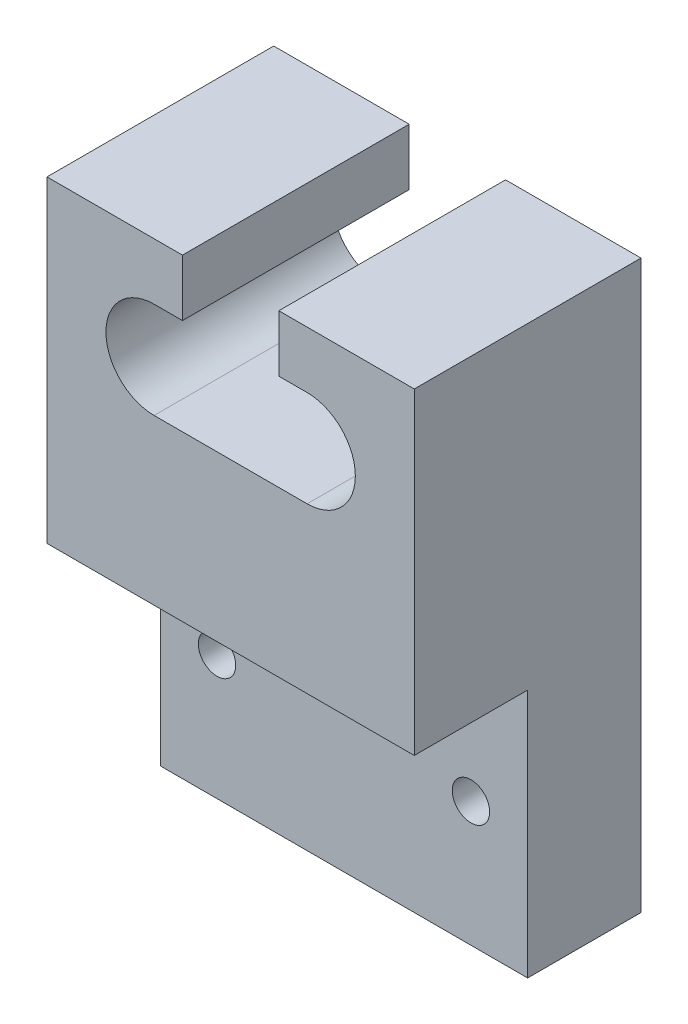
ISO-10303-21;
HEADER;
FILE_DESCRIPTION(('STEP AP214'),'2;1');
FILE_NAME('part.step','',(''),(''),'','','');
FILE_SCHEMA(('AUTOMOTIVE_DESIGN { 1 0 10303 214 1 1 1 1 }'));
ENDSEC;
DATA;
#1=APPLICATION_CONTEXT('core data for automotive mechanical design processes');
#2=APPLICATION_PROTOCOL_DEFINITION('international standard','automotive_design',2000,#1);
#3=PRODUCT_CONTEXT('',#1,'mechanical');
#4=PRODUCT('Part','Part','',(#3));
#5=PRODUCT_RELATED_PRODUCT_CATEGORY('part','',(#4));
#6=PRODUCT_DEFINITION_FORMATION('','',#4);
#7=PRODUCT_DEFINITION_CONTEXT('part definition',#1,'design');
#8=PRODUCT_DEFINITION('design','',#6,#7);
#9=PRODUCT_DEFINITION_SHAPE('','',#8);
#10=(LENGTH_UNIT() NAMED_UNIT(*) SI_UNIT(.MILLI.,.METRE.));
#11=(NAMED_UNIT(*) PLANE_ANGLE_UNIT() SI_UNIT($,.RADIAN.));
#12=(NAMED_UNIT(*) SI_UNIT($,.STERADIAN.) SOLID_ANGLE_UNIT());
#13=UNCERTAINTY_MEASURE_WITH_UNIT(LENGTH_MEASURE(1.E-05),#10,'distance_accuracy_value','');
#14=(GEOMETRIC_REPRESENTATION_CONTEXT(3) GLOBAL_UNCERTAINTY_ASSIGNED_CONTEXT((#13)) GLOBAL_UNIT_ASSIGNED_CONTEXT((#10,
#11,#12)) REPRESENTATION_CONTEXT('',''));
#15=CARTESIAN_POINT('',(0.,0.,0.));
#16=DIRECTION('',(0.,0.,1.));
#17=DIRECTION('',(1.,0.,0.));
#18=AXIS2_PLACEMENT_3D('',#15,#16,#17);
#19=CARTESIAN_POINT('',(0.,0.,20.));
#20=DIRECTION('',(0.,1.,0.));
#21=DIRECTION('',(0.,0.,1.));
#22=AXIS2_PLACEMENT_3D('',#19,#20,#21);
#23=PLANE('',#22);
#24=DIRECTION('',(0.,0.,-1.));
#25=VECTOR('',#24,1.);
#26=CARTESIAN_POINT('',(32.4000000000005,0.,20.));
#27=LINE('',#26,#25);
#28=CARTESIAN_POINT('',(32.4000000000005,0.,9.99999999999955));
#29=VERTEX_POINT('',#28);
#30=CARTESIAN_POINT('',(32.4000000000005,0.,0.));
#31=VERTEX_POINT('',#30);
#32=EDGE_CURVE('E151',#29,#31,#27,.T.);
#33=ORIENTED_EDGE('',*,*,#32,.F.);
#34=DIRECTION('',(-1.,0.,0.));
#35=VECTOR('',#34,1.);
#36=CARTESIAN_POINT('',(110.958895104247,0.,10.));
#37=LINE('',#36,#35);
#38=CARTESIAN_POINT('',(0.,0.,9.99999999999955));
#39=VERTEX_POINT('',#38);
#40=EDGE_CURVE('E148',#29,#39,#37,.T.);
#41=ORIENTED_EDGE('',*,*,#40,.T.);
#42=DIRECTION('',(0.,0.,-1.));
#43=VECTOR('',#42,1.);
#44=CARTESIAN_POINT('',(0.,0.,20.));
#45=LINE('',#44,#43);
#46=CARTESIAN_POINT('',(0.,0.,0.));
#47=VERTEX_POINT('',#46);
#48=EDGE_CURVE('E138',#39,#47,#45,.T.);
#49=ORIENTED_EDGE('',*,*,#48,.T.);
#50=DIRECTION('',(1.,0.,0.));
#51=VECTOR('',#50,1.);
#52=CARTESIAN_POINT('',(0.,0.,0.));
#53=LINE('',#52,#51);
#54=EDGE_CURVE('E208',#47,#31,#53,.T.);
#55=ORIENTED_EDGE('',*,*,#54,.T.);
#56=EDGE_LOOP('',(#33,#41,#49,#55));
#57=FACE_BOUND('',#56,.T.);
#58=ADVANCED_FACE('F32',(#57),#23,.F.);
#59=CARTESIAN_POINT('',(32.4000000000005,0.,20.));
#60=DIRECTION('',(-1.,0.,0.));
#61=DIRECTION('',(0.,0.,1.));
#62=AXIS2_PLACEMENT_3D('',#59,#60,#61);
#63=PLANE('',#62);
#64=DIRECTION('',(0.,0.,-1.));
#65=VECTOR('',#64,1.);
#66=CARTESIAN_POINT('',(32.4000000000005,22.,20.));
#67=LINE('',#66,#65);
#68=CARTESIAN_POINT('',(32.4000000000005,22.,20.));
#69=VERTEX_POINT('',#68);
#70=CARTESIAN_POINT('',(32.4000000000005,22.,9.99999999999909));
#71=VERTEX_POINT('',#70);
#72=EDGE_CURVE('E46',#69,#71,#67,.T.);
#73=ORIENTED_EDGE('',*,*,#72,.T.);
#74=DIRECTION('',(0.,-1.,0.));
#75=VECTOR('',#74,1.);
#76=CARTESIAN_POINT('',(32.4000000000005,-4.1317959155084E-13,10.));
#77=LINE('',#76,#75);
#78=EDGE_CURVE('E50',#71,#29,#77,.T.);
#79=ORIENTED_EDGE('',*,*,#78,.T.);
#80=ORIENTED_EDGE('',*,*,#32,.T.);
#81=DIRECTION('',(0.,1.,0.));
#82=VECTOR('',#81,1.);
#83=CARTESIAN_POINT('',(32.4000000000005,0.,0.));
#84=LINE('',#83,#82);
#85=CARTESIAN_POINT('',(32.4000000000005,50.,0.));
#86=VERTEX_POINT('',#85);
#87=EDGE_CURVE('E206',#31,#86,#84,.T.);
#88=ORIENTED_EDGE('',*,*,#87,.T.);
#89=DIRECTION('',(0.,0.,-1.));
#90=VECTOR('',#89,1.);
#91=CARTESIAN_POINT('',(32.4000000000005,50.,20.));
#92=LINE('',#91,#90);
#93=CARTESIAN_POINT('',(32.4000000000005,50.,20.));
#94=VERTEX_POINT('',#93);
#95=EDGE_CURVE('E152',#94,#86,#92,.T.);
#96=ORIENTED_EDGE('',*,*,#95,.F.);
#97=DIRECTION('',(0.,1.,0.));
#98=VECTOR('',#97,1.);
#99=CARTESIAN_POINT('',(32.4000000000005,0.,20.));
#100=LINE('',#99,#98);
#101=EDGE_CURVE('E187',#69,#94,#100,.T.);
#102=ORIENTED_EDGE('',*,*,#101,.F.);
#103=EDGE_LOOP('',(#73,#79,#80,#88,#96,#102));
#104=FACE_BOUND('',#103,.T.);
#105=ADVANCED_FACE('F267',(#104),#63,.F.);
#106=CARTESIAN_POINT('',(20.4500000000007,50.,20.));
#107=DIRECTION('',(0.,-1.,0.));
#108=DIRECTION('',(0.,0.,-1.));
#109=AXIS2_PLACEMENT_3D('',#106,#107,#108);
#110=PLANE('',#109);
#111=DIRECTION('',(-1.,0.,0.));
#112=VECTOR('',#111,1.);
#113=CARTESIAN_POINT('',(20.4500000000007,50.,0.));
#114=LINE('',#113,#112);
#115=CARTESIAN_POINT('',(20.4500000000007,50.,0.));
#116=VERTEX_POINT('',#115);
#117=EDGE_CURVE('E204',#86,#116,#114,.T.);
#118=ORIENTED_EDGE('',*,*,#117,.T.);
#119=DIRECTION('',(0.,0.,-1.));
#120=VECTOR('',#119,1.);
#121=CARTESIAN_POINT('',(20.4500000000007,50.,20.));
#122=LINE('',#121,#120);
#123=CARTESIAN_POINT('',(20.4500000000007,50.,20.));
#124=VERTEX_POINT('',#123);
#125=EDGE_CURVE('E157',#124,#116,#122,.T.);
#126=ORIENTED_EDGE('',*,*,#125,.F.);
#127=DIRECTION('',(-1.,0.,0.));
#128=VECTOR('',#127,1.);
#129=CARTESIAN_POINT('',(20.4500000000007,50.,20.));
#130=LINE('',#129,#128);
#131=EDGE_CURVE('E226',#94,#124,#130,.T.);
#132=ORIENTED_EDGE('',*,*,#131,.F.);
#133=ORIENTED_EDGE('',*,*,#95,.T.);
#134=EDGE_LOOP('',(#118,#126,#132,#133));
#135=FACE_BOUND('',#134,.T.);
#136=ADVANCED_FACE('F270',(#135),#110,.F.);
#137=CARTESIAN_POINT('',(20.4500000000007,45.,20.));
#138=DIRECTION('',(1.,0.,0.));
#139=DIRECTION('',(0.,0.,-1.));
#140=AXIS2_PLACEMENT_3D('',#137,#138,#139);
#141=PLANE('',#140);
#142=DIRECTION('',(0.,-1.,0.));
#143=VECTOR('',#142,1.);
#144=CARTESIAN_POINT('',(20.4500000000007,45.,0.));
#145=LINE('',#144,#143);
#146=CARTESIAN_POINT('',(20.4500000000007,45.,0.));
#147=VERTEX_POINT('',#146);
#148=EDGE_CURVE('E202',#116,#147,#145,.T.);
#149=ORIENTED_EDGE('',*,*,#148,.T.);
#150=DIRECTION('',(0.,0.,-1.));
#151=VECTOR('',#150,1.);
#152=CARTESIAN_POINT('',(20.4500000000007,45.,20.));
#153=LINE('',#152,#151);
#154=CARTESIAN_POINT('',(20.4500000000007,45.,20.));
#155=VERTEX_POINT('',#154);
#156=EDGE_CURVE('E160',#155,#147,#153,.T.);
#157=ORIENTED_EDGE('',*,*,#156,.F.);
#158=DIRECTION('',(0.,-1.,0.));
#159=VECTOR('',#158,1.);
#160=CARTESIAN_POINT('',(20.4500000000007,45.,20.));
#161=LINE('',#160,#159);
#162=EDGE_CURVE('E224',#124,#155,#161,.T.);
#163=ORIENTED_EDGE('',*,*,#162,.F.);
#164=ORIENTED_EDGE('',*,*,#125,.T.);
#165=EDGE_LOOP('',(#149,#157,#163,#164));
#166=FACE_BOUND('',#165,.T.);
#167=ADVANCED_FACE('F277',(#166),#141,.F.);
#168=CARTESIAN_POINT('',(20.4500000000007,45.,20.));
#169=DIRECTION('',(0.,1.,0.));
#170=DIRECTION('',(0.,0.,1.));
#171=AXIS2_PLACEMENT_3D('',#168,#169,#170);
#172=PLANE('',#171);
#173=DIRECTION('',(1.,0.,0.));
#174=VECTOR('',#173,1.);
#175=CARTESIAN_POINT('',(20.4500000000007,45.,0.));
#176=LINE('',#175,#174);
#177=CARTESIAN_POINT('',(22.9500000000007,45.,0.));
#178=VERTEX_POINT('',#177);
#179=EDGE_CURVE('E200',#147,#178,#176,.T.);
#180=ORIENTED_EDGE('',*,*,#179,.T.);
#181=DIRECTION('',(0.,0.,-1.));
#182=VECTOR('',#181,1.);
#183=CARTESIAN_POINT('',(22.9500000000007,45.,20.));
#184=LINE('',#183,#182);
#185=CARTESIAN_POINT('',(22.9500000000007,45.,20.));
#186=VERTEX_POINT('',#185);
#187=EDGE_CURVE('E163',#186,#178,#184,.T.);
#188=ORIENTED_EDGE('',*,*,#187,.F.);
#189=DIRECTION('',(1.,0.,0.));
#190=VECTOR('',#189,1.);
#191=CARTESIAN_POINT('',(20.4500000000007,45.,20.));
#192=LINE('',#191,#190);
#193=EDGE_CURVE('E222',#155,#186,#192,.T.);
#194=ORIENTED_EDGE('',*,*,#193,.F.);
#195=ORIENTED_EDGE('',*,*,#156,.T.);
#196=EDGE_LOOP('',(#180,#188,#194,#195));
#197=FACE_BOUND('',#196,.T.);
#198=ADVANCED_FACE('F280',(#197),#172,.F.);
#199=CARTESIAN_POINT('',(22.9500000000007,40.75,20.));
#200=DIRECTION('',(0.,0.,-1.));
#201=DIRECTION('',(-1.,0.,0.));
#202=AXIS2_PLACEMENT_3D('',#199,#200,#201);
#203=CYLINDRICAL_SURFACE('',#202,4.25);
#204=CARTESIAN_POINT('',(22.9500000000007,40.75,0.));
#205=DIRECTION('',(0.,0.,-1.));
#206=DIRECTION('',(1.,0.,0.));
#207=AXIS2_PLACEMENT_3D('',#204,#205,#206);
#208=CIRCLE('',#207,4.25);
#209=CARTESIAN_POINT('',(22.9500000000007,36.5,0.));
#210=VERTEX_POINT('',#209);
#211=EDGE_CURVE('E198',#178,#210,#208,.T.);
#212=ORIENTED_EDGE('',*,*,#211,.T.);
#213=DIRECTION('',(0.,0.,-1.));
#214=VECTOR('',#213,1.);
#215=CARTESIAN_POINT('',(22.9500000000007,36.5,20.));
#216=LINE('',#215,#214);
#217=CARTESIAN_POINT('',(22.9500000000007,36.5,20.));
#218=VERTEX_POINT('',#217);
#219=EDGE_CURVE('E166',#218,#210,#216,.T.);
#220=ORIENTED_EDGE('',*,*,#219,.F.);
#221=CARTESIAN_POINT('',(22.9500000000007,40.75,20.));
#222=DIRECTION('',(0.,0.,-1.));
#223=DIRECTION('',(1.,0.,0.));
#224=AXIS2_PLACEMENT_3D('',#221,#222,#223);
#225=CIRCLE('',#224,4.25);
#226=EDGE_CURVE('E220',#186,#218,#225,.T.);
#227=ORIENTED_EDGE('',*,*,#226,.F.);
#228=ORIENTED_EDGE('',*,*,#187,.T.);
#229=EDGE_LOOP('',(#212,#220,#227,#228));
#230=FACE_BOUND('',#229,.T.);
#231=ADVANCED_FACE('F285',(#230),#203,.F.);
#232=CARTESIAN_POINT('',(9.45000000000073,36.5,20.));
#233=DIRECTION('',(0.,-1.,0.));
#234=DIRECTION('',(0.,0.,-1.));
#235=AXIS2_PLACEMENT_3D('',#232,#233,#234);
#236=PLANE('',#235);
#237=DIRECTION('',(-1.,0.,0.));
#238=VECTOR('',#237,1.);
#239=CARTESIAN_POINT('',(9.45000000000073,36.5,0.));
#240=LINE('',#239,#238);
#241=CARTESIAN_POINT('',(9.45000000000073,36.5,0.));
#242=VERTEX_POINT('',#241);
#243=EDGE_CURVE('E196',#210,#242,#240,.T.);
#244=ORIENTED_EDGE('',*,*,#243,.T.);
#245=DIRECTION('',(0.,0.,-1.));
#246=VECTOR('',#245,1.);
#247=CARTESIAN_POINT('',(9.45000000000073,36.5,20.));
#248=LINE('',#247,#246);
#249=CARTESIAN_POINT('',(9.45000000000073,36.5,20.));
#250=VERTEX_POINT('',#249);
#251=EDGE_CURVE('E169',#250,#242,#248,.T.);
#252=ORIENTED_EDGE('',*,*,#251,.F.);
#253=DIRECTION('',(-1.,0.,0.));
#254=VECTOR('',#253,1.);
#255=CARTESIAN_POINT('',(9.45000000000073,36.5,20.));
#256=LINE('',#255,#254);
#257=EDGE_CURVE('E218',#218,#250,#256,.T.);
#258=ORIENTED_EDGE('',*,*,#257,.F.);
#259=ORIENTED_EDGE('',*,*,#219,.T.);
#260=EDGE_LOOP('',(#244,#252,#258,#259));
#261=FACE_BOUND('',#260,.T.);
#262=ADVANCED_FACE('F291',(#261),#236,.F.);
#263=CARTESIAN_POINT('',(9.45000000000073,40.75,20.));
#264=DIRECTION('',(0.,0.,-1.));
#265=DIRECTION('',(-1.,0.,0.));
#266=AXIS2_PLACEMENT_3D('',#263,#264,#265);
#267=CYLINDRICAL_SURFACE('',#266,4.25);
#268=CARTESIAN_POINT('',(9.45000000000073,40.75,0.));
#269=DIRECTION('',(0.,0.,-1.));
#270=DIRECTION('',(1.,0.,0.));
#271=AXIS2_PLACEMENT_3D('',#268,#269,#270);
#272=CIRCLE('',#271,4.25);
#273=CARTESIAN_POINT('',(9.45000000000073,45.,0.));
#274=VERTEX_POINT('',#273);
#275=EDGE_CURVE('E194',#242,#274,#272,.T.);
#276=ORIENTED_EDGE('',*,*,#275,.T.);
#277=DIRECTION('',(0.,0.,-1.));
#278=VECTOR('',#277,1.);
#279=CARTESIAN_POINT('',(9.45000000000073,45.,20.));
#280=LINE('',#279,#278);
#281=CARTESIAN_POINT('',(9.45000000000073,45.,20.));
#282=VERTEX_POINT('',#281);
#283=EDGE_CURVE('E172',#282,#274,#280,.T.);
#284=ORIENTED_EDGE('',*,*,#283,.F.);
#285=CARTESIAN_POINT('',(9.45000000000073,40.75,20.));
#286=DIRECTION('',(0.,0.,-1.));
#287=DIRECTION('',(1.,0.,0.));
#288=AXIS2_PLACEMENT_3D('',#285,#286,#287);
#289=CIRCLE('',#288,4.25);
#290=EDGE_CURVE('E216',#250,#282,#289,.T.);
#291=ORIENTED_EDGE('',*,*,#290,.F.);
#292=ORIENTED_EDGE('',*,*,#251,.T.);
#293=EDGE_LOOP('',(#276,#284,#291,#292));
#294=FACE_BOUND('',#293,.T.);
#295=ADVANCED_FACE('F295',(#294),#267,.F.);
#296=CARTESIAN_POINT('',(9.45000000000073,45.,20.));
#297=DIRECTION('',(0.,1.,0.));
#298=DIRECTION('',(0.,0.,1.));
#299=AXIS2_PLACEMENT_3D('',#296,#297,#298);
#300=PLANE('',#299);
#301=DIRECTION('',(1.,0.,0.));
#302=VECTOR('',#301,1.);
#303=CARTESIAN_POINT('',(9.45000000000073,45.,0.));
#304=LINE('',#303,#302);
#305=CARTESIAN_POINT('',(11.9500000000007,45.,0.));
#306=VERTEX_POINT('',#305);
#307=EDGE_CURVE('E192',#274,#306,#304,.T.);
#308=ORIENTED_EDGE('',*,*,#307,.T.);
#309=DIRECTION('',(0.,0.,-1.));
#310=VECTOR('',#309,1.);
#311=CARTESIAN_POINT('',(11.9500000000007,45.,20.));
#312=LINE('',#311,#310);
#313=CARTESIAN_POINT('',(11.9500000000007,45.,20.));
#314=VERTEX_POINT('',#313);
#315=EDGE_CURVE('E175',#314,#306,#312,.T.);
#316=ORIENTED_EDGE('',*,*,#315,.F.);
#317=DIRECTION('',(1.,0.,0.));
#318=VECTOR('',#317,1.);
#319=CARTESIAN_POINT('',(9.45000000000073,45.,20.));
#320=LINE('',#319,#318);
#321=EDGE_CURVE('E214',#282,#314,#320,.T.);
#322=ORIENTED_EDGE('',*,*,#321,.F.);
#323=ORIENTED_EDGE('',*,*,#283,.T.);
#324=EDGE_LOOP('',(#308,#316,#322,#323));
#325=FACE_BOUND('',#324,.T.);
#326=ADVANCED_FACE('F300',(#325),#300,.F.);
#327=CARTESIAN_POINT('',(11.9500000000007,45.,20.));
#328=DIRECTION('',(-1.,0.,0.));
#329=DIRECTION('',(0.,0.,1.));
#330=AXIS2_PLACEMENT_3D('',#327,#328,#329);
#331=PLANE('',#330);
#332=DIRECTION('',(0.,1.,0.));
#333=VECTOR('',#332,1.);
#334=CARTESIAN_POINT('',(11.9500000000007,45.,0.));
#335=LINE('',#334,#333);
#336=CARTESIAN_POINT('',(11.9500000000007,50.,0.));
#337=VERTEX_POINT('',#336);
#338=EDGE_CURVE('E190',#306,#337,#335,.T.);
#339=ORIENTED_EDGE('',*,*,#338,.T.);
#340=DIRECTION('',(0.,0.,-1.));
#341=VECTOR('',#340,1.);
#342=CARTESIAN_POINT('',(11.9500000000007,50.,20.));
#343=LINE('',#342,#341);
#344=CARTESIAN_POINT('',(11.9500000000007,50.,20.));
#345=VERTEX_POINT('',#344);
#346=EDGE_CURVE('E178',#345,#337,#343,.T.);
#347=ORIENTED_EDGE('',*,*,#346,.F.);
#348=DIRECTION('',(0.,1.,0.));
#349=VECTOR('',#348,1.);
#350=CARTESIAN_POINT('',(11.9500000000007,45.,20.));
#351=LINE('',#350,#349);
#352=EDGE_CURVE('E212',#314,#345,#351,.T.);
#353=ORIENTED_EDGE('',*,*,#352,.F.);
#354=ORIENTED_EDGE('',*,*,#315,.T.);
#355=EDGE_LOOP('',(#339,#347,#353,#354));
#356=FACE_BOUND('',#355,.T.);
#357=ADVANCED_FACE('F304',(#356),#331,.F.);
#358=CARTESIAN_POINT('',(0.,50.,20.));
#359=DIRECTION('',(0.,-1.,0.));
#360=DIRECTION('',(0.,0.,-1.));
#361=AXIS2_PLACEMENT_3D('',#358,#359,#360);
#362=PLANE('',#361);
#363=DIRECTION('',(-1.,0.,0.));
#364=VECTOR('',#363,1.);
#365=CARTESIAN_POINT('',(0.,50.,0.));
#366=LINE('',#365,#364);
#367=CARTESIAN_POINT('',(0.,50.,0.));
#368=VERTEX_POINT('',#367);
#369=EDGE_CURVE('E188',#337,#368,#366,.T.);
#370=ORIENTED_EDGE('',*,*,#369,.T.);
#371=DIRECTION('',(0.,0.,-1.));
#372=VECTOR('',#371,1.);
#373=CARTESIAN_POINT('',(0.,50.,20.));
#374=LINE('',#373,#372);
#375=CARTESIAN_POINT('',(0.,50.,20.));
#376=VERTEX_POINT('',#375);
#377=EDGE_CURVE('E181',#376,#368,#374,.T.);
#378=ORIENTED_EDGE('',*,*,#377,.F.);
#379=DIRECTION('',(-1.,0.,0.));
#380=VECTOR('',#379,1.);
#381=CARTESIAN_POINT('',(0.,50.,20.));
#382=LINE('',#381,#380);
#383=EDGE_CURVE('E134',#345,#376,#382,.T.);
#384=ORIENTED_EDGE('',*,*,#383,.F.);
#385=ORIENTED_EDGE('',*,*,#346,.T.);
#386=EDGE_LOOP('',(#370,#378,#384,#385));
#387=FACE_BOUND('',#386,.T.);
#388=ADVANCED_FACE('F307',(#387),#362,.F.);
#389=CARTESIAN_POINT('',(0.,0.,20.));
#390=DIRECTION('',(1.,0.,0.));
#391=DIRECTION('',(0.,0.,-1.));
#392=AXIS2_PLACEMENT_3D('',#389,#390,#391);
#393=PLANE('',#392);
#394=ORIENTED_EDGE('',*,*,#48,.F.);
#395=DIRECTION('',(0.,1.,0.));
#396=VECTOR('',#395,1.);
#397=CARTESIAN_POINT('',(0.,-4.1317959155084E-13,10.));
#398=LINE('',#397,#396);
#399=CARTESIAN_POINT('',(0.,22.,9.99999999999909));
#400=VERTEX_POINT('',#399);
#401=EDGE_CURVE('E11',#39,#400,#398,.T.);
#402=ORIENTED_EDGE('',*,*,#401,.T.);
#403=DIRECTION('',(0.,0.,1.));
#404=VECTOR('',#403,1.);
#405=CARTESIAN_POINT('',(0.,22.,20.));
#406=LINE('',#405,#404);
#407=CARTESIAN_POINT('',(0.,22.,20.));
#408=VERTEX_POINT('',#407);
#409=EDGE_CURVE('E141',#400,#408,#406,.T.);
#410=ORIENTED_EDGE('',*,*,#409,.T.);
#411=DIRECTION('',(0.,-1.,0.));
#412=VECTOR('',#411,1.);
#413=CARTESIAN_POINT('',(0.,0.,20.));
#414=LINE('',#413,#412);
#415=EDGE_CURVE('E129',#376,#408,#414,.T.);
#416=ORIENTED_EDGE('',*,*,#415,.F.);
#417=ORIENTED_EDGE('',*,*,#377,.T.);
#418=DIRECTION('',(0.,-1.,0.));
#419=VECTOR('',#418,1.);
#420=CARTESIAN_POINT('',(0.,0.,0.));
#421=LINE('',#420,#419);
#422=EDGE_CURVE('E184',#368,#47,#421,.T.);
#423=ORIENTED_EDGE('',*,*,#422,.T.);
#424=EDGE_LOOP('',(#394,#402,#410,#416,#417,#423));
#425=FACE_BOUND('',#424,.T.);
#426=ADVANCED_FACE('F143',(#425),#393,.F.);
#427=CARTESIAN_POINT('',(22.9500000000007,40.75,20.));
#428=DIRECTION('',(0.,0.,1.));
#429=DIRECTION('',(1.,0.,0.));
#430=AXIS2_PLACEMENT_3D('',#427,#428,#429);
#431=PLANE('',#430);
#432=DIRECTION('',(-1.,0.,0.));
#433=VECTOR('',#432,1.);
#434=CARTESIAN_POINT('',(22.9500000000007,22.,20.));
#435=LINE('',#434,#433);
#436=EDGE_CURVE('E39',#69,#408,#435,.T.);
#437=ORIENTED_EDGE('',*,*,#436,.F.);
#438=ORIENTED_EDGE('',*,*,#101,.T.);
#439=ORIENTED_EDGE('',*,*,#131,.T.);
#440=ORIENTED_EDGE('',*,*,#162,.T.);
#441=ORIENTED_EDGE('',*,*,#193,.T.);
#442=ORIENTED_EDGE('',*,*,#226,.T.);
#443=ORIENTED_EDGE('',*,*,#257,.T.);
#444=ORIENTED_EDGE('',*,*,#290,.T.);
#445=ORIENTED_EDGE('',*,*,#321,.T.);
#446=ORIENTED_EDGE('',*,*,#352,.T.);
#447=ORIENTED_EDGE('',*,*,#383,.T.);
#448=ORIENTED_EDGE('',*,*,#415,.T.);
#449=EDGE_LOOP('',(#437,#438,#439,#440,#441,#442,#443,#444,#445,#446,#447,#448));
#450=FACE_BOUND('',#449,.T.);
#451=ADVANCED_FACE('F131',(#450),#431,.T.);
#452=CARTESIAN_POINT('',(22.9500000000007,40.75,0.));
#453=DIRECTION('',(0.,0.,1.));
#454=DIRECTION('',(1.,0.,0.));
#455=AXIS2_PLACEMENT_3D('',#452,#453,#454);
#456=PLANE('',#455);
#457=CARTESIAN_POINT('',(27.3999999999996,11.0000000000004,0.));
#458=DIRECTION('',(0.,0.,1.));
#459=DIRECTION('',(1.,0.,0.));
#460=AXIS2_PLACEMENT_3D('',#457,#458,#459);
#461=CIRCLE('',#460,1.64999999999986);
#462=CARTESIAN_POINT('',(29.0499999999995,11.0000000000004,0.));
#463=VERTEX_POINT('',#462);
#464=EDGE_CURVE('E240',#463,#463,#461,.T.);
#465=ORIENTED_EDGE('',*,*,#464,.T.);
#466=EDGE_LOOP('',(#465));
#467=FACE_BOUND('',#466,.T.);
#468=CARTESIAN_POINT('',(5.,11.0000000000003,0.));
#469=DIRECTION('',(0.,0.,1.));
#470=DIRECTION('',(1.,0.,0.));
#471=AXIS2_PLACEMENT_3D('',#468,#469,#470);
#472=CIRCLE('',#471,1.64999999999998);
#473=CARTESIAN_POINT('',(6.64999999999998,11.0000000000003,0.));
#474=VERTEX_POINT('',#473);
#475=EDGE_CURVE('E234',#474,#474,#472,.T.);
#476=ORIENTED_EDGE('',*,*,#475,.T.);
#477=EDGE_LOOP('',(#476));
#478=FACE_BOUND('',#477,.T.);
#479=ORIENTED_EDGE('',*,*,#54,.F.);
#480=ORIENTED_EDGE('',*,*,#422,.F.);
#481=ORIENTED_EDGE('',*,*,#369,.F.);
#482=ORIENTED_EDGE('',*,*,#338,.F.);
#483=ORIENTED_EDGE('',*,*,#307,.F.);
#484=ORIENTED_EDGE('',*,*,#275,.F.);
#485=ORIENTED_EDGE('',*,*,#243,.F.);
#486=ORIENTED_EDGE('',*,*,#211,.F.);
#487=ORIENTED_EDGE('',*,*,#179,.F.);
#488=ORIENTED_EDGE('',*,*,#148,.F.);
#489=ORIENTED_EDGE('',*,*,#117,.F.);
#490=ORIENTED_EDGE('',*,*,#87,.F.);
#491=EDGE_LOOP('',(#479,#480,#481,#482,#483,#484,#485,#486,#487,#488,#489,#490));
#492=FACE_BOUND('',#491,.T.);
#493=ADVANCED_FACE('F253',(#467,#478,#492),#456,.F.);
#494=CARTESIAN_POINT('',(110.958895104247,0.,10.));
#495=DIRECTION('',(0.,0.,-1.));
#496=DIRECTION('',(0.,1.,0.));
#497=AXIS2_PLACEMENT_3D('',#494,#495,#496);
#498=PLANE('',#497);
#499=CARTESIAN_POINT('',(27.3999999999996,11.0000000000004,10.));
#500=DIRECTION('',(0.,0.,1.));
#501=DIRECTION('',(1.,0.,0.));
#502=AXIS2_PLACEMENT_3D('',#499,#500,#501);
#503=CIRCLE('',#502,1.64999999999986);
#504=CARTESIAN_POINT('',(29.0499999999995,11.0000000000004,10.));
#505=VERTEX_POINT('',#504);
#506=EDGE_CURVE('E243',#505,#505,#503,.T.);
#507=ORIENTED_EDGE('',*,*,#506,.F.);
#508=EDGE_LOOP('',(#507));
#509=FACE_BOUND('',#508,.T.);
#510=CARTESIAN_POINT('',(5.,11.0000000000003,10.));
#511=DIRECTION('',(0.,0.,1.));
#512=DIRECTION('',(1.,0.,0.));
#513=AXIS2_PLACEMENT_3D('',#510,#511,#512);
#514=CIRCLE('',#513,1.64999999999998);
#515=CARTESIAN_POINT('',(6.64999999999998,11.0000000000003,10.));
#516=VERTEX_POINT('',#515);
#517=EDGE_CURVE('E237',#516,#516,#514,.T.);
#518=ORIENTED_EDGE('',*,*,#517,.F.);
#519=EDGE_LOOP('',(#518));
#520=FACE_BOUND('',#519,.T.);
#521=ORIENTED_EDGE('',*,*,#78,.F.);
#522=DIRECTION('',(-1.,0.,0.));
#523=VECTOR('',#522,1.);
#524=CARTESIAN_POINT('',(110.958895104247,22.,9.99999999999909));
#525=LINE('',#524,#523);
#526=EDGE_CURVE('E232',#71,#400,#525,.T.);
#527=ORIENTED_EDGE('',*,*,#526,.T.);
#528=ORIENTED_EDGE('',*,*,#401,.F.);
#529=ORIENTED_EDGE('',*,*,#40,.F.);
#530=EDGE_LOOP('',(#521,#527,#528,#529));
#531=FACE_BOUND('',#530,.T.);
#532=ADVANCED_FACE('F250',(#509,#520,#531),#498,.F.);
#533=CARTESIAN_POINT('',(110.958895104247,22.,20.));
#534=DIRECTION('',(0.,1.,0.));
#535=DIRECTION('',(0.,0.,1.));
#536=AXIS2_PLACEMENT_3D('',#533,#534,#535);
#537=PLANE('',#536);
#538=ORIENTED_EDGE('',*,*,#72,.F.);
#539=ORIENTED_EDGE('',*,*,#436,.T.);
#540=ORIENTED_EDGE('',*,*,#409,.F.);
#541=ORIENTED_EDGE('',*,*,#526,.F.);
#542=EDGE_LOOP('',(#538,#539,#540,#541));
#543=FACE_BOUND('',#542,.T.);
#544=ADVANCED_FACE('F150',(#543),#537,.F.);
#545=CARTESIAN_POINT('',(5.,11.0000000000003,-10.));
#546=DIRECTION('',(0.,0.,1.));
#547=DIRECTION('',(1.,0.,0.));
#548=AXIS2_PLACEMENT_3D('',#545,#546,#547);
#549=CYLINDRICAL_SURFACE('',#548,1.64999999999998);
#550=ORIENTED_EDGE('',*,*,#517,.T.);
#551=EDGE_LOOP('',(#550));
#552=FACE_BOUND('',#551,.T.);
#553=ORIENTED_EDGE('',*,*,#475,.F.);
#554=EDGE_LOOP('',(#553));
#555=FACE_BOUND('',#554,.T.);
#556=ADVANCED_FACE('F382',(#552,#555),#549,.F.);
#557=CARTESIAN_POINT('',(27.3999999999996,11.0000000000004,-10.));
#558=DIRECTION('',(0.,0.,1.));
#559=DIRECTION('',(1.,0.,0.));
#560=AXIS2_PLACEMENT_3D('',#557,#558,#559);
#561=CYLINDRICAL_SURFACE('',#560,1.64999999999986);
#562=ORIENTED_EDGE('',*,*,#506,.T.);
#563=EDGE_LOOP('',(#562));
#564=FACE_BOUND('',#563,.T.);
#565=ORIENTED_EDGE('',*,*,#464,.F.);
#566=EDGE_LOOP('',(#565));
#567=FACE_BOUND('',#566,.T.);
#568=ADVANCED_FACE('F247',(#564,#567),#561,.F.);
#569=CLOSED_SHELL('',(#58,#105,#136,#167,#198,#231,#262,#295,#326,#357,#388,#426,#451,#493,#532,
#544,#556,#568));
#570=MANIFOLD_SOLID_BREP('B2',#569);
#571=ADVANCED_BREP_SHAPE_REPRESENTATION('',(#18,#570),#14);
#572=SHAPE_DEFINITION_REPRESENTATION(#9,#571);
ENDSEC;
END-ISO-10303-21;
